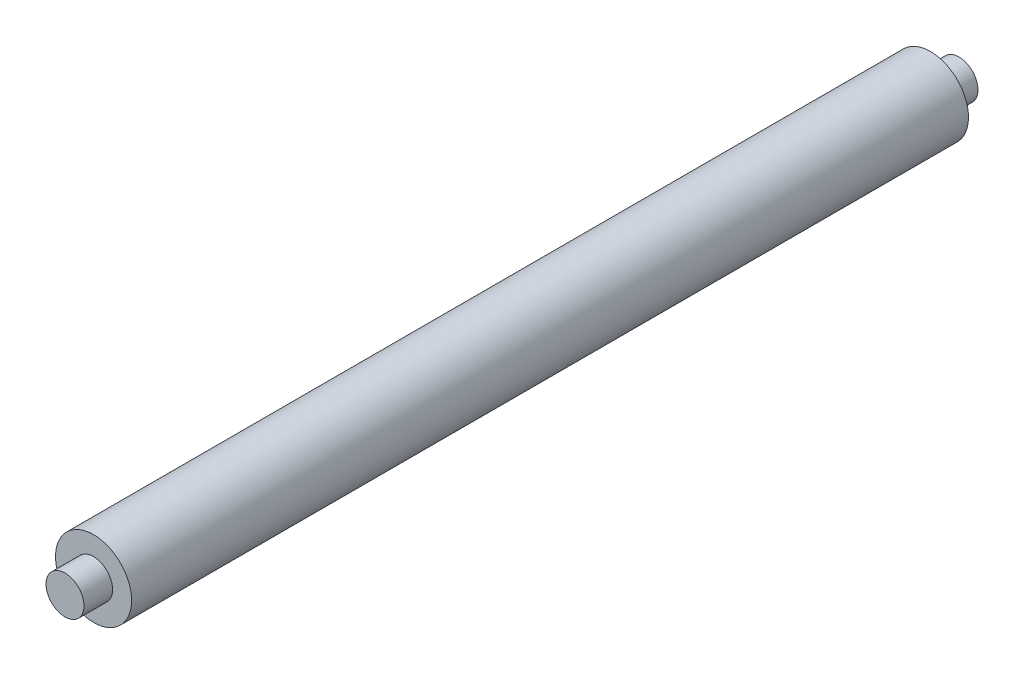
ISO-10303-21;
HEADER;
FILE_DESCRIPTION(('STEP AP214'),'2;1');
FILE_NAME('part.step','',(''),(''),'','','');
FILE_SCHEMA(('AUTOMOTIVE_DESIGN { 1 0 10303 214 1 1 1 1 }'));
ENDSEC;
DATA;
#1=APPLICATION_CONTEXT('core data for automotive mechanical design processes');
#2=APPLICATION_PROTOCOL_DEFINITION('international standard','automotive_design',2000,#1);
#3=PRODUCT_CONTEXT('',#1,'mechanical');
#4=PRODUCT('Part','Part','',(#3));
#5=PRODUCT_RELATED_PRODUCT_CATEGORY('part','',(#4));
#6=PRODUCT_DEFINITION_FORMATION('','',#4);
#7=PRODUCT_DEFINITION_CONTEXT('part definition',#1,'design');
#8=PRODUCT_DEFINITION('design','',#6,#7);
#9=PRODUCT_DEFINITION_SHAPE('','',#8);
#10=(LENGTH_UNIT() NAMED_UNIT(*) SI_UNIT(.MILLI.,.METRE.));
#11=(NAMED_UNIT(*) PLANE_ANGLE_UNIT() SI_UNIT($,.RADIAN.));
#12=(NAMED_UNIT(*) SI_UNIT($,.STERADIAN.) SOLID_ANGLE_UNIT());
#13=UNCERTAINTY_MEASURE_WITH_UNIT(LENGTH_MEASURE(1.E-05),#10,'distance_accuracy_value','');
#14=(GEOMETRIC_REPRESENTATION_CONTEXT(3) GLOBAL_UNCERTAINTY_ASSIGNED_CONTEXT((#13)) GLOBAL_UNIT_ASSIGNED_CONTEXT((#10,
#11,#12)) REPRESENTATION_CONTEXT('',''));
#15=CARTESIAN_POINT('',(0.,0.,0.));
#16=DIRECTION('',(0.,0.,1.));
#17=DIRECTION('',(1.,0.,0.));
#18=AXIS2_PLACEMENT_3D('',#15,#16,#17);
#19=CARTESIAN_POINT('',(0.,0.,279.4));
#20=DIRECTION('',(0.,0.,1.));
#21=DIRECTION('',(1.,0.,0.));
#22=AXIS2_PLACEMENT_3D('',#19,#20,#21);
#23=PLANE('',#22);
#24=CARTESIAN_POINT('',(0.,0.,279.4));
#25=DIRECTION('',(0.,0.,1.));
#26=DIRECTION('',(1.,0.,0.));
#27=AXIS2_PLACEMENT_3D('',#24,#25,#26);
#28=CIRCLE('',#27,25.4);
#29=CARTESIAN_POINT('',(25.4,0.,279.4));
#30=VERTEX_POINT('',#29);
#31=EDGE_CURVE('E10',#30,#30,#28,.T.);
#32=ORIENTED_EDGE('',*,*,#31,.T.);
#33=EDGE_LOOP('',(#32));
#34=FACE_BOUND('',#33,.T.);
#35=CARTESIAN_POINT('',(0.,0.,279.4));
#36=DIRECTION('',(0.,0.,1.));
#37=DIRECTION('',(1.,0.,0.));
#38=AXIS2_PLACEMENT_3D('',#35,#36,#37);
#39=CIRCLE('',#38,12.7);
#40=CARTESIAN_POINT('',(-12.7,0.,279.4));
#41=VERTEX_POINT('',#40);
#42=EDGE_CURVE('E41',#41,#41,#39,.T.);
#43=ORIENTED_EDGE('',*,*,#42,.F.);
#44=EDGE_LOOP('',(#43));
#45=FACE_BOUND('',#44,.T.);
#46=ADVANCED_FACE('F26',(#34,#45),#23,.T.);
#47=CARTESIAN_POINT('',(0.,0.,279.4));
#48=DIRECTION('',(0.,0.,-1.));
#49=DIRECTION('',(-1.,0.,0.));
#50=AXIS2_PLACEMENT_3D('',#47,#48,#49);
#51=CYLINDRICAL_SURFACE('',#50,25.4);
#52=ORIENTED_EDGE('',*,*,#31,.F.);
#53=EDGE_LOOP('',(#52));
#54=FACE_BOUND('',#53,.T.);
#55=CARTESIAN_POINT('',(0.,0.,-279.4));
#56=DIRECTION('',(0.,0.,1.));
#57=DIRECTION('',(1.,0.,0.));
#58=AXIS2_PLACEMENT_3D('',#55,#56,#57);
#59=CIRCLE('',#58,25.4);
#60=CARTESIAN_POINT('',(25.4,0.,-279.4));
#61=VERTEX_POINT('',#60);
#62=EDGE_CURVE('E33',#61,#61,#59,.T.);
#63=ORIENTED_EDGE('',*,*,#62,.T.);
#64=EDGE_LOOP('',(#63));
#65=FACE_BOUND('',#64,.T.);
#66=ADVANCED_FACE('F28',(#54,#65),#51,.T.);
#67=CARTESIAN_POINT('',(0.,0.,-279.4));
#68=DIRECTION('',(0.,0.,1.));
#69=DIRECTION('',(1.,0.,0.));
#70=AXIS2_PLACEMENT_3D('',#67,#68,#69);
#71=PLANE('',#70);
#72=CARTESIAN_POINT('',(0.,0.,-279.4));
#73=DIRECTION('',(0.,0.,1.));
#74=DIRECTION('',(1.,0.,0.));
#75=AXIS2_PLACEMENT_3D('',#72,#73,#74);
#76=CIRCLE('',#75,12.7);
#77=CARTESIAN_POINT('',(12.7,0.,-279.4));
#78=VERTEX_POINT('',#77);
#79=EDGE_CURVE('E49',#78,#78,#76,.T.);
#80=ORIENTED_EDGE('',*,*,#79,.T.);
#81=EDGE_LOOP('',(#80));
#82=FACE_BOUND('',#81,.T.);
#83=ORIENTED_EDGE('',*,*,#62,.F.);
#84=EDGE_LOOP('',(#83));
#85=FACE_BOUND('',#84,.T.);
#86=ADVANCED_FACE('F53',(#82,#85),#71,.F.);
#87=CARTESIAN_POINT('',(0.,0.,298.45));
#88=DIRECTION('',(0.,0.,-1.));
#89=DIRECTION('',(-1.,0.,0.));
#90=AXIS2_PLACEMENT_3D('',#87,#88,#89);
#91=CYLINDRICAL_SURFACE('',#90,12.7);
#92=CARTESIAN_POINT('',(0.,0.,298.45));
#93=DIRECTION('',(0.,0.,1.));
#94=DIRECTION('',(1.,0.,0.));
#95=AXIS2_PLACEMENT_3D('',#92,#93,#94);
#96=CIRCLE('',#95,12.7);
#97=CARTESIAN_POINT('',(-12.7,0.,298.45));
#98=VERTEX_POINT('',#97);
#99=EDGE_CURVE('E37',#98,#98,#96,.T.);
#100=CARTESIAN_POINT('',(-12.7,0.,298.45));
#101=CARTESIAN_POINT('',(-12.7,0.,298.2515625));
#102=CARTESIAN_POINT('',(-12.7,0.,298.053125));
#103=CARTESIAN_POINT('',(-12.7,0.,297.65625));
#104=CARTESIAN_POINT('',(-12.7,0.,297.4578125));
#105=CARTESIAN_POINT('',(-12.7,0.,297.0609375));
#106=CARTESIAN_POINT('',(-12.7,0.,296.8625));
#107=CARTESIAN_POINT('',(-12.7,0.,296.465625));
#108=CARTESIAN_POINT('',(-12.7,0.,296.2671875));
#109=CARTESIAN_POINT('',(-12.7,0.,295.8703125));
#110=CARTESIAN_POINT('',(-12.7,0.,295.671875));
#111=CARTESIAN_POINT('',(-12.7,0.,295.275));
#112=CARTESIAN_POINT('',(-12.7,0.,295.0765625));
#113=CARTESIAN_POINT('',(-12.7,0.,294.6796875));
#114=CARTESIAN_POINT('',(-12.7,0.,294.48125));
#115=CARTESIAN_POINT('',(-12.7,0.,294.084375));
#116=CARTESIAN_POINT('',(-12.7,0.,293.8859375));
#117=CARTESIAN_POINT('',(-12.7,0.,293.4890625));
#118=CARTESIAN_POINT('',(-12.7,0.,293.290625));
#119=CARTESIAN_POINT('',(-12.7,0.,292.89375));
#120=CARTESIAN_POINT('',(-12.7,0.,292.6953125));
#121=CARTESIAN_POINT('',(-12.7,0.,292.2984375));
#122=CARTESIAN_POINT('',(-12.7,0.,292.1));
#123=CARTESIAN_POINT('',(-12.7,0.,291.703125));
#124=CARTESIAN_POINT('',(-12.7,0.,291.5046875));
#125=CARTESIAN_POINT('',(-12.7,0.,291.1078125));
#126=CARTESIAN_POINT('',(-12.7,0.,290.909375));
#127=CARTESIAN_POINT('',(-12.7,0.,290.5125));
#128=CARTESIAN_POINT('',(-12.7,0.,290.3140625));
#129=CARTESIAN_POINT('',(-12.7,0.,289.9171875));
#130=CARTESIAN_POINT('',(-12.7,0.,289.71875));
#131=CARTESIAN_POINT('',(-12.7,0.,289.321875));
#132=CARTESIAN_POINT('',(-12.7,0.,289.1234375));
#133=CARTESIAN_POINT('',(-12.7,0.,288.7265625));
#134=CARTESIAN_POINT('',(-12.7,0.,288.528125));
#135=CARTESIAN_POINT('',(-12.7,0.,288.13125));
#136=CARTESIAN_POINT('',(-12.7,0.,287.9328125));
#137=CARTESIAN_POINT('',(-12.7,0.,287.5359375));
#138=CARTESIAN_POINT('',(-12.7,0.,287.3375));
#139=CARTESIAN_POINT('',(-12.7,0.,286.940625));
#140=CARTESIAN_POINT('',(-12.7,0.,286.7421875));
#141=CARTESIAN_POINT('',(-12.7,0.,286.3453125));
#142=CARTESIAN_POINT('',(-12.7,0.,286.146875));
#143=CARTESIAN_POINT('',(-12.7,0.,285.75));
#144=CARTESIAN_POINT('',(-12.7,0.,285.5515625));
#145=CARTESIAN_POINT('',(-12.7,0.,285.1546875));
#146=CARTESIAN_POINT('',(-12.7,0.,284.95625));
#147=CARTESIAN_POINT('',(-12.7,0.,284.559375));
#148=CARTESIAN_POINT('',(-12.7,0.,284.3609375));
#149=CARTESIAN_POINT('',(-12.7,0.,283.9640625));
#150=CARTESIAN_POINT('',(-12.7,0.,283.765625));
#151=CARTESIAN_POINT('',(-12.7,0.,283.36875));
#152=CARTESIAN_POINT('',(-12.7,0.,283.1703125));
#153=CARTESIAN_POINT('',(-12.7,0.,282.7734375));
#154=CARTESIAN_POINT('',(-12.7,0.,282.575));
#155=CARTESIAN_POINT('',(-12.7,0.,282.178125));
#156=CARTESIAN_POINT('',(-12.7,0.,281.9796875));
#157=CARTESIAN_POINT('',(-12.7,0.,281.5828125));
#158=CARTESIAN_POINT('',(-12.7,0.,281.384375));
#159=CARTESIAN_POINT('',(-12.7,0.,280.9875));
#160=CARTESIAN_POINT('',(-12.7,0.,280.7890625));
#161=CARTESIAN_POINT('',(-12.7,0.,280.3921875));
#162=CARTESIAN_POINT('',(-12.7,0.,280.19375));
#163=CARTESIAN_POINT('',(-12.7,0.,279.796875));
#164=CARTESIAN_POINT('',(-12.7,0.,279.5984375));
#165=CARTESIAN_POINT('',(-12.7,0.,279.4));
#166=B_SPLINE_CURVE_WITH_KNOTS('',3,(#100,#101,#102,#103,#104,#105,#106,#107,#108,#109,#110,
#111,#112,#113,#114,#115,#116,#117,#118,#119,#120,#121,#122,#123,#124,#125,#126,#127,#128,#129,
#130,#131,#132,#133,#134,#135,#136,#137,#138,#139,#140,#141,#142,#143,#144,#145,#146,#147,#148,
#149,#150,#151,#152,#153,#154,#155,#156,#157,#158,#159,#160,#161,#162,#163,#164,#165),
.UNSPECIFIED.,.F.,.F.,(4,2,2,2,2,2,2,2,2,2,2,2,2,2,2,2,2,2,2,2,2,2,2,2,2,2,2,2,2,2,2,2,4),(0.,
0.5953125,1.190625,1.7859375,2.38125,2.9765625,3.571875,4.1671875,4.7625,5.3578125,5.953125,
6.5484375,7.14375,7.7390625,8.334375,8.92968750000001,9.52500000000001,10.1203125,10.715625,
11.3109375,11.90625,12.5015625,13.096875,13.6921875,14.2875,14.8828125,15.478125,16.0734375,
16.66875,17.2640625,17.859375,18.4546875,19.05),.UNSPECIFIED.);
#167=EDGE_CURVE('BSEAM69',#98,#41,#166,.T.);
#168=ORIENTED_EDGE('',*,*,#99,.F.);
#169=ORIENTED_EDGE('',*,*,#42,.T.);
#170=ORIENTED_EDGE('',*,*,#167,.T.);
#171=ORIENTED_EDGE('',*,*,#167,.F.);
#172=EDGE_LOOP('',(#168,#170,#169,#171));
#173=FACE_BOUND('',#172,.T.);
#174=ADVANCED_FACE('F69',(#173),#91,.T.);
#175=CARTESIAN_POINT('',(0.,0.,298.45));
#176=DIRECTION('',(0.,0.,1.));
#177=DIRECTION('',(1.,0.,0.));
#178=AXIS2_PLACEMENT_3D('',#175,#176,#177);
#179=PLANE('',#178);
#180=ORIENTED_EDGE('',*,*,#99,.T.);
#181=EDGE_LOOP('',(#180));
#182=FACE_BOUND('',#181,.T.);
#183=ADVANCED_FACE('F59',(#182),#179,.T.);
#184=CARTESIAN_POINT('',(0.,0.,-298.45));
#185=DIRECTION('',(0.,0.,1.));
#186=DIRECTION('',(1.,0.,0.));
#187=AXIS2_PLACEMENT_3D('',#184,#185,#186);
#188=CYLINDRICAL_SURFACE('',#187,12.7);
#189=CARTESIAN_POINT('',(0.,0.,-298.45));
#190=DIRECTION('',(0.,0.,1.));
#191=DIRECTION('',(1.,0.,0.));
#192=AXIS2_PLACEMENT_3D('',#189,#190,#191);
#193=CIRCLE('',#192,12.7);
#194=CARTESIAN_POINT('',(12.7,0.,-298.45));
#195=VERTEX_POINT('',#194);
#196=EDGE_CURVE('E46',#195,#195,#193,.T.);
#197=CARTESIAN_POINT('',(12.7,0.,-298.45));
#198=CARTESIAN_POINT('',(12.7,0.,-298.2515625));
#199=CARTESIAN_POINT('',(12.7,0.,-298.053125));
#200=CARTESIAN_POINT('',(12.7,0.,-297.65625));
#201=CARTESIAN_POINT('',(12.7,0.,-297.4578125));
#202=CARTESIAN_POINT('',(12.7,0.,-297.0609375));
#203=CARTESIAN_POINT('',(12.7,0.,-296.8625));
#204=CARTESIAN_POINT('',(12.7,0.,-296.465625));
#205=CARTESIAN_POINT('',(12.7,0.,-296.2671875));
#206=CARTESIAN_POINT('',(12.7,0.,-295.8703125));
#207=CARTESIAN_POINT('',(12.7,0.,-295.671875));
#208=CARTESIAN_POINT('',(12.7,0.,-295.275));
#209=CARTESIAN_POINT('',(12.7,0.,-295.0765625));
#210=CARTESIAN_POINT('',(12.7,0.,-294.6796875));
#211=CARTESIAN_POINT('',(12.7,0.,-294.48125));
#212=CARTESIAN_POINT('',(12.7,0.,-294.084375));
#213=CARTESIAN_POINT('',(12.7,0.,-293.8859375));
#214=CARTESIAN_POINT('',(12.7,0.,-293.4890625));
#215=CARTESIAN_POINT('',(12.7,0.,-293.290625));
#216=CARTESIAN_POINT('',(12.7,0.,-292.89375));
#217=CARTESIAN_POINT('',(12.7,0.,-292.6953125));
#218=CARTESIAN_POINT('',(12.7,0.,-292.2984375));
#219=CARTESIAN_POINT('',(12.7,0.,-292.1));
#220=CARTESIAN_POINT('',(12.7,0.,-291.703125));
#221=CARTESIAN_POINT('',(12.7,0.,-291.5046875));
#222=CARTESIAN_POINT('',(12.7,0.,-291.1078125));
#223=CARTESIAN_POINT('',(12.7,0.,-290.909375));
#224=CARTESIAN_POINT('',(12.7,0.,-290.5125));
#225=CARTESIAN_POINT('',(12.7,0.,-290.3140625));
#226=CARTESIAN_POINT('',(12.7,0.,-289.9171875));
#227=CARTESIAN_POINT('',(12.7,0.,-289.71875));
#228=CARTESIAN_POINT('',(12.7,0.,-289.321875));
#229=CARTESIAN_POINT('',(12.7,0.,-289.1234375));
#230=CARTESIAN_POINT('',(12.7,0.,-288.7265625));
#231=CARTESIAN_POINT('',(12.7,0.,-288.528125));
#232=CARTESIAN_POINT('',(12.7,0.,-288.13125));
#233=CARTESIAN_POINT('',(12.7,0.,-287.9328125));
#234=CARTESIAN_POINT('',(12.7,0.,-287.5359375));
#235=CARTESIAN_POINT('',(12.7,0.,-287.3375));
#236=CARTESIAN_POINT('',(12.7,0.,-286.940625));
#237=CARTESIAN_POINT('',(12.7,0.,-286.7421875));
#238=CARTESIAN_POINT('',(12.7,0.,-286.3453125));
#239=CARTESIAN_POINT('',(12.7,0.,-286.146875));
#240=CARTESIAN_POINT('',(12.7,0.,-285.75));
#241=CARTESIAN_POINT('',(12.7,0.,-285.5515625));
#242=CARTESIAN_POINT('',(12.7,0.,-285.1546875));
#243=CARTESIAN_POINT('',(12.7,0.,-284.95625));
#244=CARTESIAN_POINT('',(12.7,0.,-284.559375));
#245=CARTESIAN_POINT('',(12.7,0.,-284.3609375));
#246=CARTESIAN_POINT('',(12.7,0.,-283.9640625));
#247=CARTESIAN_POINT('',(12.7,0.,-283.765625));
#248=CARTESIAN_POINT('',(12.7,0.,-283.36875));
#249=CARTESIAN_POINT('',(12.7,0.,-283.1703125));
#250=CARTESIAN_POINT('',(12.7,0.,-282.7734375));
#251=CARTESIAN_POINT('',(12.7,0.,-282.575));
#252=CARTESIAN_POINT('',(12.7,0.,-282.178125));
#253=CARTESIAN_POINT('',(12.7,0.,-281.9796875));
#254=CARTESIAN_POINT('',(12.7,0.,-281.5828125));
#255=CARTESIAN_POINT('',(12.7,0.,-281.384375));
#256=CARTESIAN_POINT('',(12.7,0.,-280.9875));
#257=CARTESIAN_POINT('',(12.7,0.,-280.7890625));
#258=CARTESIAN_POINT('',(12.7,0.,-280.3921875));
#259=CARTESIAN_POINT('',(12.7,0.,-280.19375));
#260=CARTESIAN_POINT('',(12.7,0.,-279.796875));
#261=CARTESIAN_POINT('',(12.7,0.,-279.5984375));
#262=CARTESIAN_POINT('',(12.7,0.,-279.4));
#263=B_SPLINE_CURVE_WITH_KNOTS('',3,(#197,#198,#199,#200,#201,#202,#203,#204,#205,#206,#207,
#208,#209,#210,#211,#212,#213,#214,#215,#216,#217,#218,#219,#220,#221,#222,#223,#224,#225,#226,
#227,#228,#229,#230,#231,#232,#233,#234,#235,#236,#237,#238,#239,#240,#241,#242,#243,#244,#245,
#246,#247,#248,#249,#250,#251,#252,#253,#254,#255,#256,#257,#258,#259,#260,#261,#262),
.UNSPECIFIED.,.F.,.F.,(4,2,2,2,2,2,2,2,2,2,2,2,2,2,2,2,2,2,2,2,2,2,2,2,2,2,2,2,2,2,2,2,4),(0.,
0.595312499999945,1.19062499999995,1.78593749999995,2.38124999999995,2.97656249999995,
3.57187499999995,4.16718749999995,4.76249999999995,5.35781249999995,5.95312499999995,
6.54843749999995,7.14374999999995,7.73906249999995,8.33437499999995,8.92968749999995,
9.52499999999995,10.1203125,10.715625,11.3109375,11.90625,12.5015625,13.096875,13.6921875,
14.2875,14.8828125,15.478125,16.0734375,16.66875,17.2640625,17.859375,18.4546875,19.05),.UNSPECIFIED.);
#264=EDGE_CURVE('BSEAM56',#195,#78,#263,.T.);
#265=ORIENTED_EDGE('',*,*,#196,.T.);
#266=ORIENTED_EDGE('',*,*,#79,.F.);
#267=ORIENTED_EDGE('',*,*,#264,.T.);
#268=ORIENTED_EDGE('',*,*,#264,.F.);
#269=EDGE_LOOP('',(#265,#267,#266,#268));
#270=FACE_BOUND('',#269,.T.);
#271=ADVANCED_FACE('F56',(#270),#188,.T.);
#272=CARTESIAN_POINT('',(0.,0.,-298.45));
#273=DIRECTION('',(0.,0.,-1.));
#274=DIRECTION('',(1.,0.,0.));
#275=AXIS2_PLACEMENT_3D('',#272,#273,#274);
#276=PLANE('',#275);
#277=ORIENTED_EDGE('',*,*,#196,.F.);
#278=EDGE_LOOP('',(#277));
#279=FACE_BOUND('',#278,.T.);
#280=ADVANCED_FACE('F58',(#279),#276,.T.);
#281=CLOSED_SHELL('',(#46,#66,#86,#174,#183,#271,#280));
#282=MANIFOLD_SOLID_BREP('B2',#281);
#283=ADVANCED_BREP_SHAPE_REPRESENTATION('',(#18,#282),#14);
#284=SHAPE_DEFINITION_REPRESENTATION(#9,#283);
ENDSEC;
END-ISO-10303-21;
